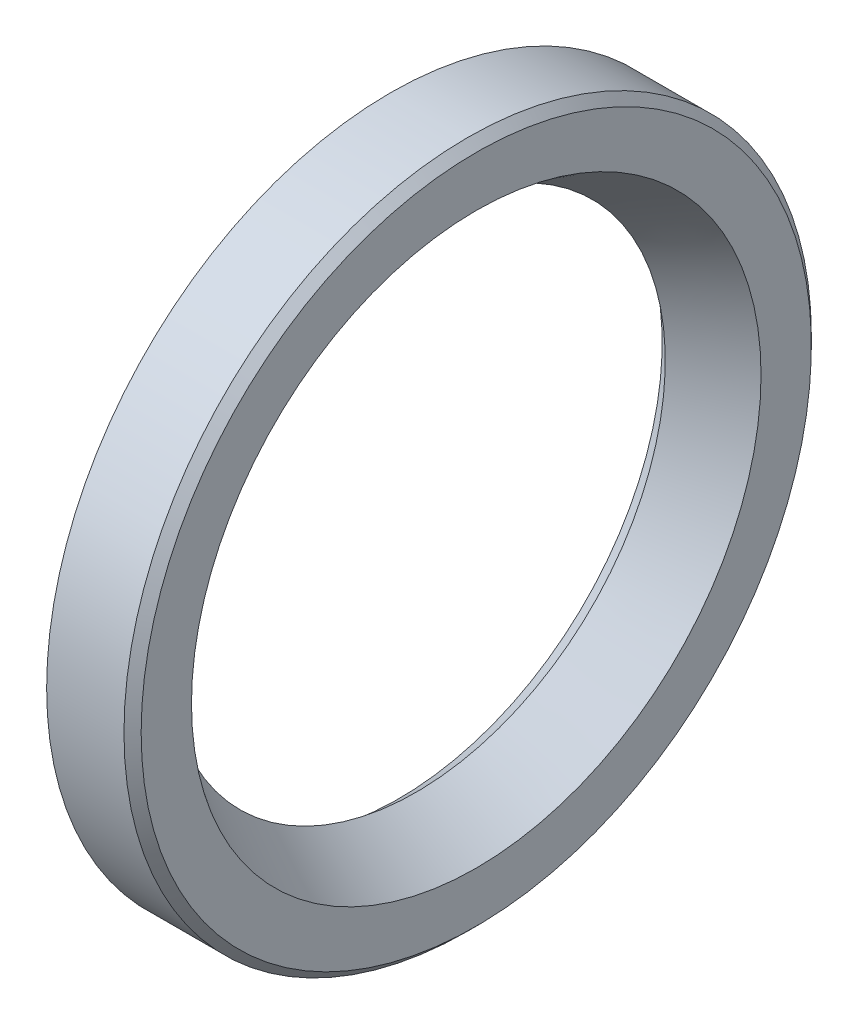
from build123d import *


with BuildPart() as part:
    # Ske → Base-Rev (revolve)
    with BuildSketch(Plane.XY, mode=Mode.PRIVATE) as base_rev_sk:
        with BuildLine():
            Line((2, 33.142857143), (1, 33.142857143))
            Line((1, 33.142857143), (1, 30.641731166))
            Line((1, 30.641731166), (3, 29))
            Line((3, 29), (10, 33.142857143))
            Line((10, 33.142857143), (10, 39))
            Line((10, 39), (9, 40))
            Line((9, 40), (0, 40))
            Line((0, 40), (0, 38.222222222))
            Line((0, 38.222222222), (5.666666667, 38.222222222))
            ThreePointArc((5.666666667, 38.222222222), (6.373773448, 37.929329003), (6.666666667, 37.222222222))
            Line((6.666666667, 37.222222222), (6.666666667, 33.142857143))
            ThreePointArc((6.666666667, 33.142857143), (6.373773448, 32.435750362), (5.666666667, 32.142857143))
            Line((5.666666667, 32.142857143), (3, 32.142857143))
            ThreePointArc((3, 32.142857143), (3.707106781, 33.849963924), (2, 33.142857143))
        make_face()
    revolve(base_rev_sk.sketch.rotate(Axis((-10, 0, 0), (1, 0, 0)), 90), axis=Axis((-10, 0, 0), (1, 0, 0)))


solid = part.part
